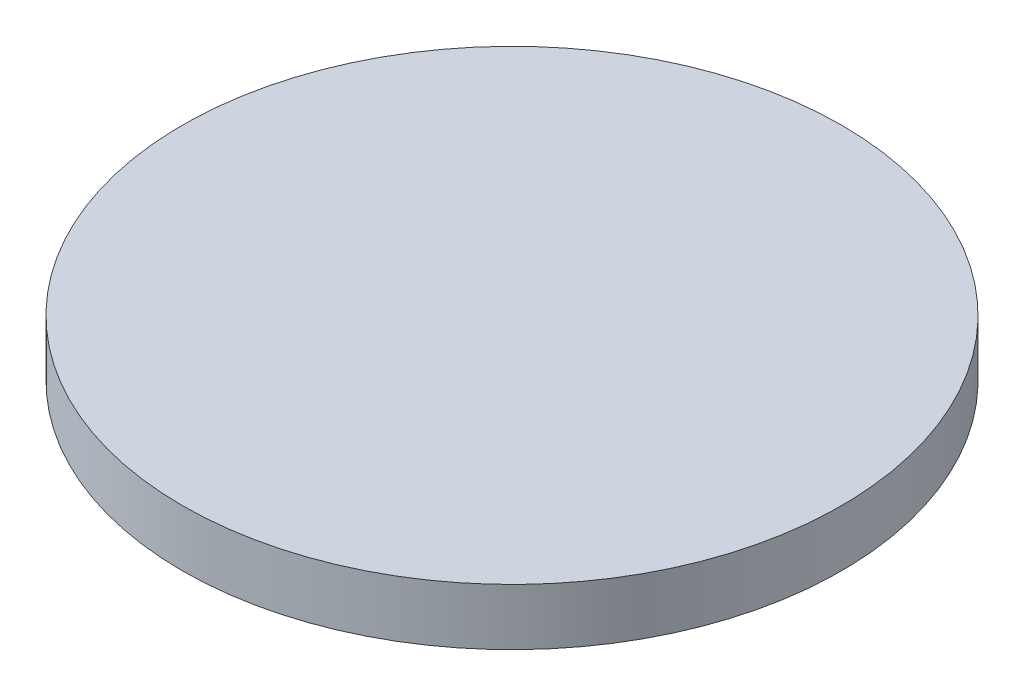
from build123d import *

# Parameters (mm, degrees)
ESQUISSE1_R      = 175
EXTRUSION1_DEPTH = 30


with BuildPart() as part:
    # Esquisse1 → Extrusion1 (new body)
    with BuildSketch(Plane(origin=(0, 0, 0), x_dir=(1, 0, 0), z_dir=(0, 1, 0))):
        with Locations(Location((0, 0, 0), (0, 0, 270))):
            Circle(ESQUISSE1_R)
    extrude(amount=EXTRUSION1_DEPTH)


solid = part.part
